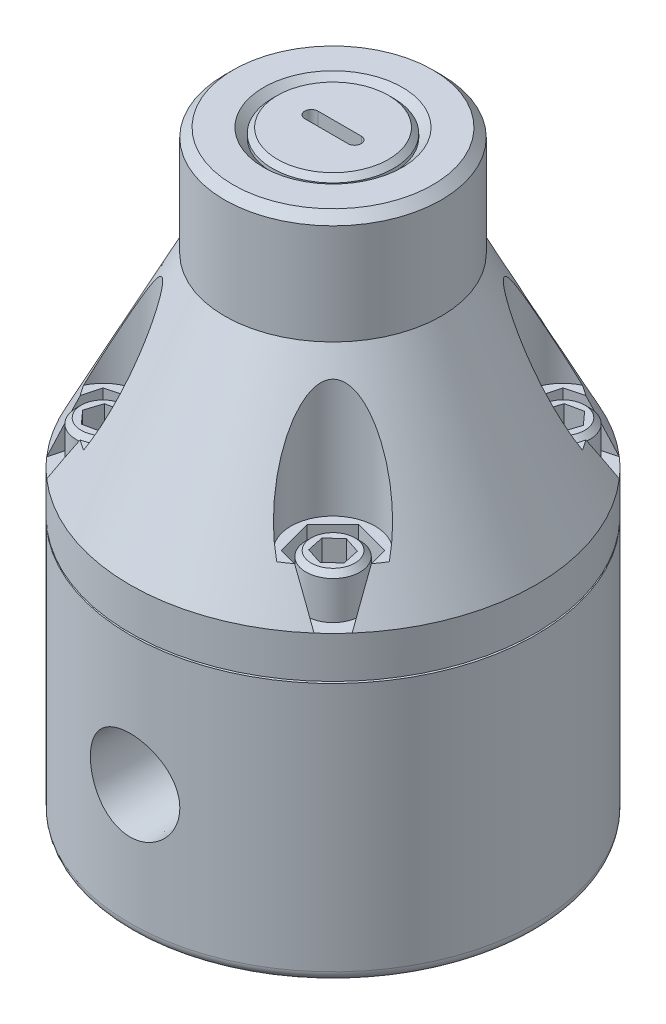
from build123d import *

# Parameters (mm, degrees)
SKETCH1_R                    = 29.718
EXTRUDE1_DEPTH               = 87.63
SKETCH3_R                    = 10.16
EXTRUDE2_DEPTH               = 1.27
EXTRUDE2_DRAFT               = -45
CIRPATTERN1_COUNT            = 2
CHAMFER1_SIZE                = 1.27
FILLET1_R                    = 1.524
EXTRUDE4_REACH               = 99.187
SKETCH7_R                    = 8.89
EXTRUDE5_DEPTH               = 4.7498
CHAMFER4_SIZE                = 0.762
SKETCH11_R                   = 6.1722
EXTRUDE6_DEPTH               = 21.2598
CIRPATTERN2_COUNT            = 4
EXTRUDE7_DEPTH               = 6.35
CIRPATTERN3_COUNT            = 4
SKETCH13_R                   = 3.9624
EXTRUDE8_DEPTH               = 6.35
EXTRUDE9_DEPTH               = 3.175
CHAMFER5_SIZE                = 0.762
CIRPATTERN4_COUNT            = 4
CHAMFER5_OF_CIRPATTERN4_SIZE = 0.762


with BuildPart() as part:
    # Sketch1 → Extrude1 (new body)
    with BuildSketch(Plane(origin=(0, 0, 0), x_dir=(1, 0, 0), z_dir=(0, 1, 0))):
        with Locations(Location((0, 0, 0), (0, 0, 270))):
            Circle(SKETCH1_R)
    extrude(amount=EXTRUDE1_DEPTH)

    # Sketch2 → Cut-Revolve1 (revolve, cut)
    with BuildSketch(Plane.XY, mode=Mode.PRIVATE) as cut_revolve1_sk:
        Polygon((-34.543868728, 38.1), (-19.05, 38.1), (-19.05, 38.354), (-29.718, 38.354), (-29.718, 44.45), (-15.875, 71.628), (-15.875, 89.288493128), (-34.543868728, 89.288493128), align=None)
    revolve(cut_revolve1_sk.sketch.rotate(Axis((0, 0, 0), (0, 1, 0)), 270), axis=Axis((0, 0, 0), (0, 1, 0)), mode=Mode.SUBTRACT)


with BuildPart() as extrude2_tool:
    # Sketch3 → Extrude2 (with draft: the straight prism first)
    with BuildSketch(Plane(origin=(0, 87.63, 0), x_dir=(-1, 0, 0), z_dir=(0, 1, 0))):
        Circle(SKETCH3_R)
    extrude(amount=-EXTRUDE2_DEPTH)
    # Extrude2: the draft: its side faces are tilted about the plane it starts from
    extrude2_sides = [extrude2_tool.faces().sort_by_distance(p)[0] for p in [
        (10.16, 86.995, 0),
    ]]
    draft(extrude2_sides, Plane(origin=(0, 87.63, 0), x_dir=(-1, 0, 0), z_dir=(0, 1, 0)), EXTRUDE2_DRAFT)


with BuildPart() as part_1:
    add(part.part)

    # Extrude2: cut by extrude2_tool
    add(extrude2_tool.part, mode=Mode.SUBTRACT)

    # Sketch6 → 1_4 Rc Tapped Hole1 (revolve, cut)
    with BuildSketch(Plane(origin=(0, 19.05, 29.718), x_dir=(0, -1, 0), z_dir=(1, 0, 0))):
        Polygon((0, 0), (0, 19.742042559), (5.35, 17.526), (5.35, 10.922), (6.235117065, 10.922), (6.576065, 0), align=None)
    f_1_4_rc_tapped_hole1 = revolve(axis=Axis((0, 19.05, 36.068), (0, 0, -1)), mode=Mode.SUBTRACT)

    # CirPattern1: 1_4 Rc Tapped Hole1 ×2 about axis
    cirpattern1_axis = Axis((0, 87.63, 0), (0, -1, 0))
    for i in range(1, CIRPATTERN1_COUNT):
        add(f_1_4_rc_tapped_hole1.rotate(cirpattern1_axis, i * 360 / CIRPATTERN1_COUNT), mode=Mode.SUBTRACT)

    # Chamfer1
    chamfer1_edges = [part_1.edges().sort_by_distance(p)[0] for p in [
        (0, 87.63, 15.875),
    ]]
    chamfer(chamfer1_edges, length=CHAMFER1_SIZE)

    # Fillet1
    fillet1_edges = [part_1.edges().sort_by_distance(p)[0] for p in [
        (0, 0, -29.718),
    ]]
    fillet(fillet1_edges, radius=FILLET1_R)

    # Extrude4: up to this cone (the profile starts inside it)
    extrude4_end = Plane(origin=(0, 87.63, 0), z_dir=(0, 1, 0)).offset(-10.159999) * Cone(1e-06, 120.007, 120.006999, align=(Align.CENTER, Align.CENTER, Align.MIN), mode=Mode.PRIVATE)
    # Sketch7 → Extrude4 (add, up to the surface)
    with BuildSketch(Plane(origin=(0, 87.63, 0), x_dir=(-1, 0, 0), z_dir=(0, 1, 0)), mode=Mode.PRIVATE) as extrude4_sk1:
        with Locations(Location((0, 0, 0), (0, 0, 90))):
            Circle(SKETCH7_R)
    extrude4_tool1 = extrude(extrude4_sk1.sketch, amount=-EXTRUDE4_REACH, mode=Mode.PRIVATE) & extrude4_end
    add(extrude4_tool1.solids().sort_by_distance((0, 87.63, 0))[0])

    # Sketch10 → Extrude5 (cut)
    with BuildSketch(Plane(origin=(0, 87.63, 0), x_dir=(-1, 0, 0), z_dir=(0, 1, 0))):
        with BuildLine():
            Line((-3.175, 0.9652), (3.175, 0.9652))
            ThreePointArc((3.175, 0.9652), (4.1402, 0), (3.175, -0.9652))
            Line((3.175, -0.9652), (-3.175, -0.9652))
            ThreePointArc((-3.175, -0.9652), (-4.1402, 0), (-3.175, 0.9652))
        make_face()
    extrude(amount=-EXTRUDE5_DEPTH, mode=Mode.SUBTRACT)

    # Chamfer4
    chamfer4_edges = [part_1.edges().sort_by_distance(p)[0] for p in [
        (0, 87.63, -8.89),
    ]]
    chamfer(chamfer4_edges, length=CHAMFER4_SIZE)

    # Sketch11 → Extrude6 (cut)
    with BuildSketch(Plane(origin=(0, 50.8, 0), x_dir=(-1, 0, 0), z_dir=(0, 1, 0))):
        with Locations((-16.837980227, -16.837980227)):
            Circle(SKETCH11_R)
    extrude6 = extrude(amount=EXTRUDE6_DEPTH, mode=Mode.SUBTRACT)

    # CirPattern2: Extrude6 ×4 about axis
    cirpattern2_axis = Axis((0, 0, 0), (0, 1, 0))
    for i in range(1, CIRPATTERN2_COUNT):
        add(extrude6.rotate(cirpattern2_axis, i * 360 / CIRPATTERN2_COUNT), mode=Mode.SUBTRACT)

    # Sketch12 → Extrude7 (cut)
    with BuildSketch(Plane(origin=(0, 50.8, 0), x_dir=(-1, 0, 0), z_dir=(0, 1, 0))):
        Polygon((-20.625559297, -13.064574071), (-23.373711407, -23.398259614), (-13.050401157, -20.611386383), (-11.676325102, -15.444543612), (-15.463904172, -11.671137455), align=None)
    extrude7 = extrude(amount=-EXTRUDE7_DEPTH, mode=Mode.SUBTRACT)

    # CirPattern3: Extrude7 ×4 about axis
    cirpattern3_axis = Axis((0, 0, 0), (0, 1, 0))
    for i in range(1, CIRPATTERN3_COUNT):
        add(extrude7.rotate(cirpattern3_axis, i * 360 / CIRPATTERN3_COUNT), mode=Mode.SUBTRACT)

    # Sketch13 → Extrude8 (add)
    with BuildSketch(Plane(origin=(0, 50.8, 0), x_dir=(-1, 0, 0), z_dir=(0, 1, 0))):
        with Locations(Location((-16.832776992, -16.843181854, 0), (0, 0, 90))):
            Circle(SKETCH13_R)
    extrude8 = extrude(amount=-EXTRUDE8_DEPTH)

    # Sketch14 → Extrude9 (cut)
    with BuildSketch(Plane(origin=(0, 50.8, 0), x_dir=(-1, 0, 0), z_dir=(0, 1, 0))):
        Polygon((-15.143118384, -18.718782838), (-14.36362959, -16.317695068), (-16.053288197, -14.442094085), (-18.5224356, -14.967580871), (-19.301924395, -17.368668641), (-17.612265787, -19.244269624), align=None)
    extrude9 = extrude(amount=-EXTRUDE9_DEPTH, mode=Mode.SUBTRACT)

    # Chamfer5
    chamfer5_edges = [part_1.edges().sort_by_distance(p)[0] for p in [
        (16.832776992, 50.8, -20.805581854),
    ]]
    chamfer(chamfer5_edges, length=CHAMFER5_SIZE)

    # CirPattern4: Extrude8, Extrude9 ×4 about axis
    cirpattern4_axis = Axis((0, 0, 0), (0, 1, 0))
    add([extrude8.rotate(cirpattern4_axis, i * 360 / CIRPATTERN4_COUNT) for i in range(1, CIRPATTERN4_COUNT)])
    add([extrude9.rotate(cirpattern4_axis, i * 360 / CIRPATTERN4_COUNT) for i in range(1, CIRPATTERN4_COUNT)], mode=Mode.SUBTRACT)

    # Chamfer5 of CirPattern4
    chamfer5_of_cirpattern4_edges = [part_1.edges().sort_by_distance(p)[0] for p in [
        (-20.805581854, 50.8, -16.832776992),
        (-16.832776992, 50.8, 20.805581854),
        (20.805581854, 50.8, 16.832776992),
    ]]
    chamfer(chamfer5_of_cirpattern4_edges, length=CHAMFER5_OF_CIRPATTERN4_SIZE)


solid = part_1.part
